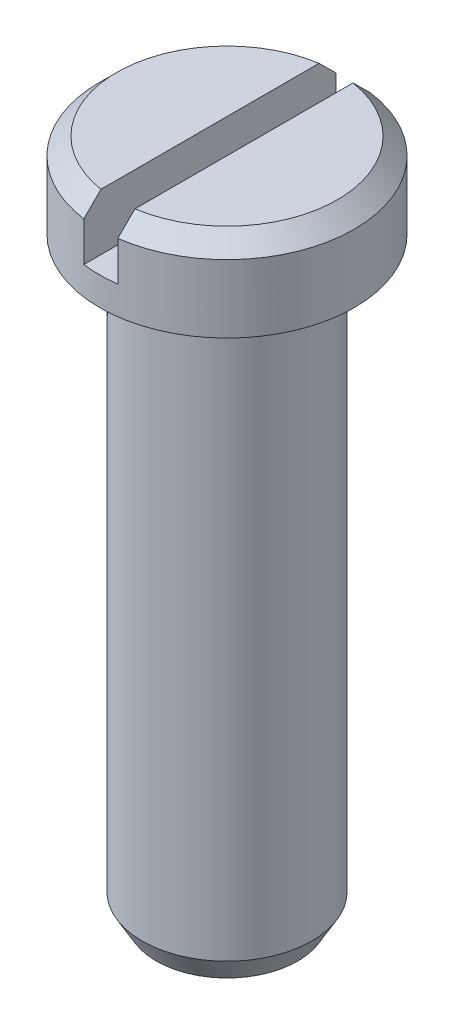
from build123d import *

# Parameters (mm, degrees)
SKETCH_10_R         = 1.5
EXTRUDE_1_DEPTH     = 12
SKETCH_12_W         = 0.5
SKETCH_12_H         = 3.174459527
CUT_EXTRUDE_5_DEPTH = 0.9503947
CHAMFER_2_SIZE      = 0.2
CHAMFER_3_SIZE      = 0.25
CHAMFER_3_SIZE2     = 0.433012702
SKETCH_13_W         = 2
SKETCH_13_H         = 1.5
SKETCH_14_W         = 0.6
SKETCH_14_H         = 4.869532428
CUT_EXTRUDE_6_DEPTH = 1
CHAMFER_4_SIZE      = 0.3


with BuildPart() as part:
    # Sketch 10 → Extrude 1 (new body)
    with BuildSketch(Plane(origin=(0, 0, 0), x_dir=(1, 0, 0), z_dir=(0, 1, 0))):
        with Locations(Location((0, 0, 0), (0, 0, 270))):
            Circle(SKETCH_10_R)
    extrude(amount=EXTRUDE_1_DEPTH)

    # Sketch 12 → Cut-Extrude 5 (cut)
    with BuildSketch(Plane(origin=(0, 12, 0), x_dir=(-1, 0, 0), z_dir=(0, 1, 0))):
        with Locations((0, 0.049773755)):
            Rectangle(SKETCH_12_W, SKETCH_12_H)
    extrude(amount=-CUT_EXTRUDE_5_DEPTH, mode=Mode.SUBTRACT)

    # Chamfer 2
    chamfer_2_edges = [part.edges().sort_by_distance(p)[0] for p in [
        (1.5, 12, 0),
        (-1.5, 12, 0),
    ]]
    chamfer(chamfer_2_edges, length=CHAMFER_2_SIZE)

    # Chamfer 3
    chamfer_3_edges = [part.edges().sort_by_distance(p)[0] for p in [
        (0, 0, -1.5),
    ]]
    chamfer_3_side = [part.faces().sort_by_distance(p)[0] for p in [
        (0, 0, 0),
    ]]
    chamfer(chamfer_3_edges, length=CHAMFER_3_SIZE, length2=CHAMFER_3_SIZE2, reference=chamfer_3_side[0])

    # Sketch 13 → Revolve 1 (revolve)
    with BuildSketch(Plane.XY, mode=Mode.PRIVATE) as revolve_1_sk:
        with Locations((-1.25, 11.25)):
            Rectangle(SKETCH_13_W, SKETCH_13_H)
    revolve(revolve_1_sk.sketch.rotate(Axis((0, 0, 0), (0, 1, 0)), 270), axis=Axis((0, 0, 0), (0, 1, 0)))

    # Sketch 14 → Cut-Extrude 6 (cut)
    with BuildSketch(Plane(origin=(0, 12, 0), x_dir=(-1, 0, 0), z_dir=(0, 1, 0))):
        with Locations((0, 0.045625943)):
            Rectangle(SKETCH_14_W, SKETCH_14_H)
    extrude(amount=-CUT_EXTRUDE_6_DEPTH, mode=Mode.SUBTRACT)

    # Chamfer 4
    chamfer_4_edges = [part.edges().sort_by_distance(p)[0] for p in [
        (2.25, 12, 0),
        (-2.25, 12, 0),
    ]]
    chamfer(chamfer_4_edges, length=CHAMFER_4_SIZE)


solid = part.part
